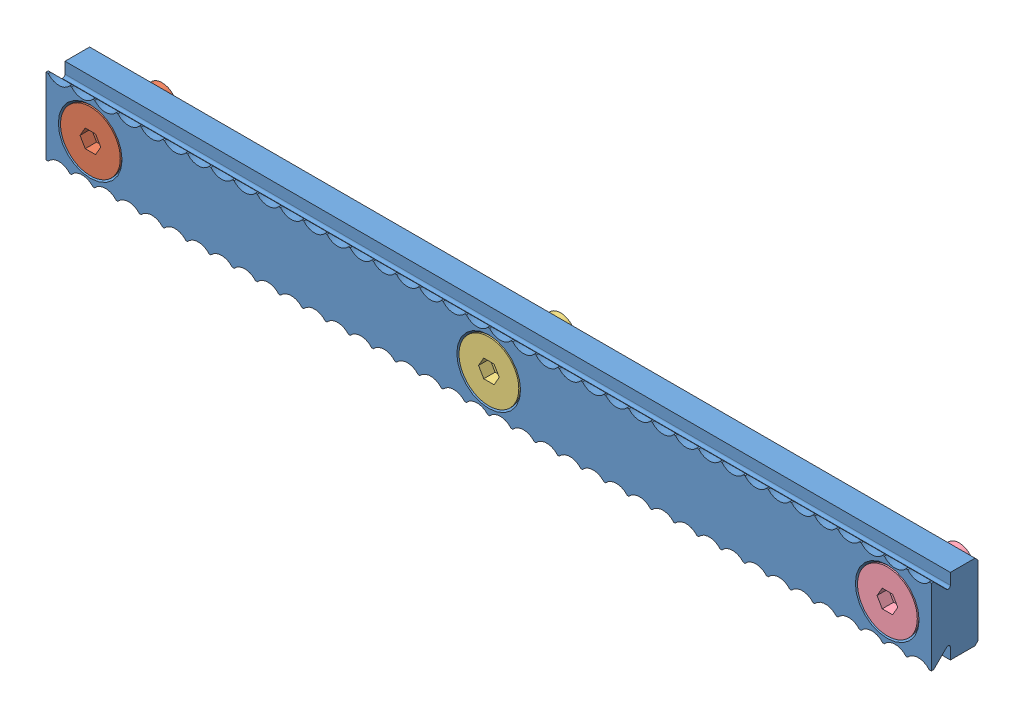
SolidWorks assembly TSG-150.sldasm, configuration Default (file format 9000). Lengths in mm.
Overall size (148.13 12.7 12.03).
4 component instances, 4 part files, 0 mates.
Components (placement in the parent):
- TSG-150_01-1: TSG-150_01.sldprt [ﾃﾞﾌｫﾙﾄ] at (66.675 -0.0127 4.6228) size (148.13 12.7 7.8)
- TSG-150_02-1: TSG-150_02.sldprt [ﾃﾞﾌｫﾙﾄ] at (0 0 7.7638) size (10 10 12)
- TSG-150_03-1: TSG-150_03.sldprt [ﾃﾞﾌｫﾙﾄ] at (66.675 0 7.7638) size (10 10 12)
- TSG-150_04-1: TSG-150_04.sldprt [ﾃﾞﾌｫﾙﾄ] at (133.35 0 7.7638) size (10 10 12)
